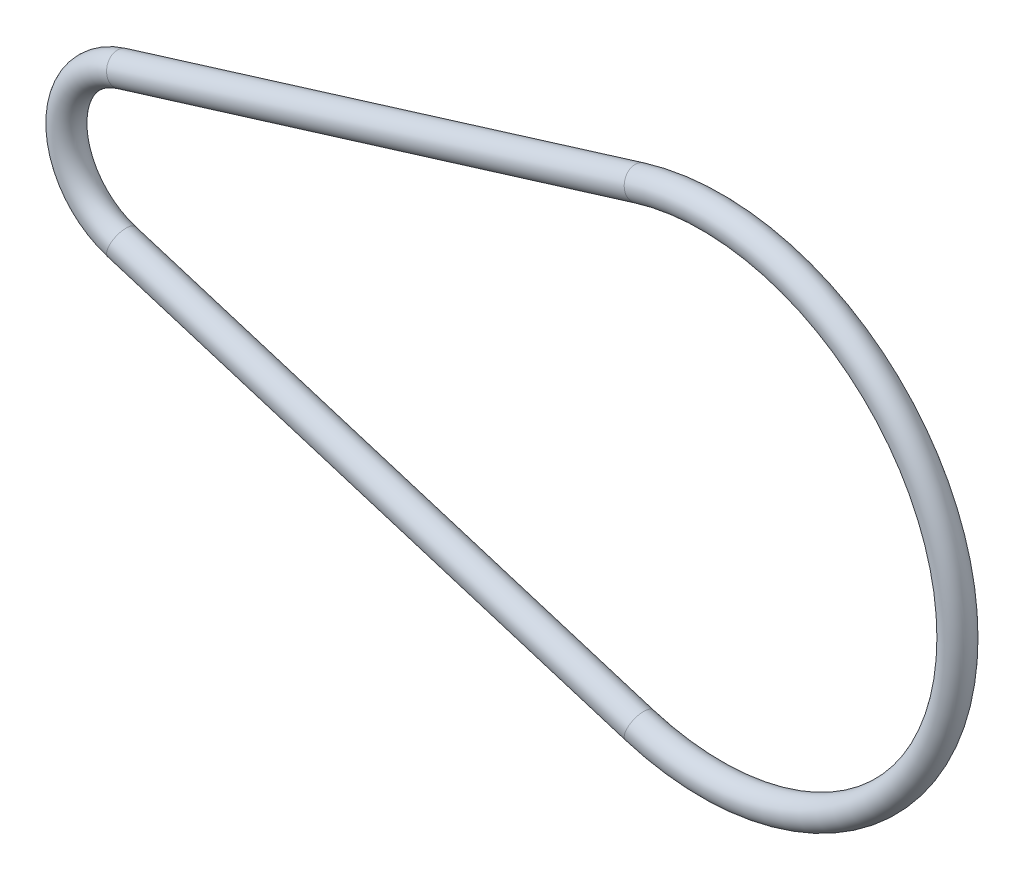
ISO-10303-21;
HEADER;
FILE_DESCRIPTION(('STEP AP214'),'2;1');
FILE_NAME('part.step','',(''),(''),'','','');
FILE_SCHEMA(('AUTOMOTIVE_DESIGN { 1 0 10303 214 1 1 1 1 }'));
ENDSEC;
DATA;
#1=APPLICATION_CONTEXT('core data for automotive mechanical design processes');
#2=APPLICATION_PROTOCOL_DEFINITION('international standard','automotive_design',2000,#1);
#3=PRODUCT_CONTEXT('',#1,'mechanical');
#4=PRODUCT('Part','Part','',(#3));
#5=PRODUCT_RELATED_PRODUCT_CATEGORY('part','',(#4));
#6=PRODUCT_DEFINITION_FORMATION('','',#4);
#7=PRODUCT_DEFINITION_CONTEXT('part definition',#1,'design');
#8=PRODUCT_DEFINITION('design','',#6,#7);
#9=PRODUCT_DEFINITION_SHAPE('','',#8);
#10=(LENGTH_UNIT() NAMED_UNIT(*) SI_UNIT(.MILLI.,.METRE.));
#11=(NAMED_UNIT(*) PLANE_ANGLE_UNIT() SI_UNIT($,.RADIAN.));
#12=(NAMED_UNIT(*) SI_UNIT($,.STERADIAN.) SOLID_ANGLE_UNIT());
#13=UNCERTAINTY_MEASURE_WITH_UNIT(LENGTH_MEASURE(1.E-05),#10,'distance_accuracy_value','');
#14=(GEOMETRIC_REPRESENTATION_CONTEXT(3) GLOBAL_UNCERTAINTY_ASSIGNED_CONTEXT((#13)) GLOBAL_UNIT_ASSIGNED_CONTEXT((#10,
#11,#12)) REPRESENTATION_CONTEXT('',''));
#15=CARTESIAN_POINT('',(0.,0.,0.));
#16=DIRECTION('',(0.,0.,1.));
#17=DIRECTION('',(1.,0.,0.));
#18=AXIS2_PLACEMENT_3D('',#15,#16,#17);
#19=CARTESIAN_POINT('',(-1.59230769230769,-5.15989885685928,0.));
#20=DIRECTION('',(0.955536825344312,-0.294871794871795,0.));
#21=DIRECTION('',(0.294871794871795,0.955536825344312,0.));
#22=AXIS2_PLACEMENT_3D('',#19,#20,#21);
#23=CYLINDRICAL_SURFACE('',#22,0.999999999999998);
#24=CARTESIAN_POINT('',(-1.59230769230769,-5.15989885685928,0.));
#25=DIRECTION('',(0.955536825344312,-0.294871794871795,0.));
#26=DIRECTION('',(0.,0.,1.));
#27=AXIS2_PLACEMENT_3D('',#24,#25,#26);
#28=CIRCLE('',#27,0.999999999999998);
#29=CARTESIAN_POINT('',(-1.88717948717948,-6.11543568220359,0.));
#30=VERTEX_POINT('',#29);
#31=EDGE_CURVE('E35',#30,#30,#28,.T.);
#32=ORIENTED_EDGE('',*,*,#31,.T.);
#33=EDGE_LOOP('',(#32));
#34=FACE_BOUND('',#33,.T.);
#35=CARTESIAN_POINT('',(34.0166666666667,-16.1485723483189,0.));
#36=DIRECTION('',(0.955536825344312,-0.294871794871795,0.));
#37=DIRECTION('',(0.,0.,1.));
#38=AXIS2_PLACEMENT_3D('',#35,#36,#37);
#39=CIRCLE('',#38,0.999999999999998);
#40=CARTESIAN_POINT('',(33.7217948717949,-17.1041091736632,0.));
#41=VERTEX_POINT('',#40);
#42=EDGE_CURVE('E10',#41,#41,#39,.T.);
#43=ORIENTED_EDGE('',*,*,#42,.F.);
#44=EDGE_LOOP('',(#43));
#45=FACE_BOUND('',#44,.T.);
#46=ADVANCED_FACE('F29',(#34,#45),#23,.T.);
#47=CARTESIAN_POINT('',(0.,0.,0.));
#48=DIRECTION('',(0.,0.,1.));
#49=DIRECTION('',(1.,0.,0.));
#50=AXIS2_PLACEMENT_3D('',#47,#48,#49);
#51=TOROIDAL_SURFACE('',#50,5.39999999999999,0.999999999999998);
#52=CARTESIAN_POINT('',(-1.59230769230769,5.15989885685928,0.));
#53=DIRECTION('',(-0.955536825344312,-0.294871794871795,0.));
#54=DIRECTION('',(0.,0.,1.));
#55=AXIS2_PLACEMENT_3D('',#52,#53,#54);
#56=CIRCLE('',#55,0.999999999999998);
#57=CARTESIAN_POINT('',(-1.88717948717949,6.11543568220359,0.));
#58=VERTEX_POINT('',#57);
#59=EDGE_CURVE('E39',#58,#58,#56,.T.);
#60=CARTESIAN_POINT('',(0.,0.,0.));
#61=DIRECTION('',(0.,0.,1.));
#62=DIRECTION('',(1.,0.,0.));
#63=AXIS2_PLACEMENT_3D('',#60,#61,#62);
#64=CIRCLE('',#63,6.39999999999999);
#65=EDGE_CURVE('',#58,#30,#64,.T.);
#66=ORIENTED_EDGE('',*,*,#59,.T.);
#67=ORIENTED_EDGE('',*,*,#31,.F.);
#68=ORIENTED_EDGE('',*,*,#65,.T.);
#69=ORIENTED_EDGE('',*,*,#65,.F.);
#70=EDGE_LOOP('',(#66,#68,#67,#69));
#71=FACE_BOUND('',#70,.T.);
#72=ADVANCED_FACE('F58',(#71),#51,.T.);
#73=CARTESIAN_POINT('',(34.0166666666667,16.1485723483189,0.));
#74=DIRECTION('',(-0.955536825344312,-0.294871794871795,0.));
#75=DIRECTION('',(0.294871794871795,-0.955536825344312,0.));
#76=AXIS2_PLACEMENT_3D('',#73,#74,#75);
#77=CYLINDRICAL_SURFACE('',#76,0.999999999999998);
#78=CARTESIAN_POINT('',(34.0166666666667,16.1485723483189,0.));
#79=DIRECTION('',(-0.955536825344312,-0.294871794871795,0.));
#80=DIRECTION('',(0.,0.,1.));
#81=AXIS2_PLACEMENT_3D('',#78,#79,#80);
#82=CIRCLE('',#81,0.999999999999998);
#83=CARTESIAN_POINT('',(33.7217948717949,17.1041091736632,0.));
#84=VERTEX_POINT('',#83);
#85=EDGE_CURVE('E43',#84,#84,#82,.T.);
#86=ORIENTED_EDGE('',*,*,#85,.T.);
#87=EDGE_LOOP('',(#86));
#88=FACE_BOUND('',#87,.T.);
#89=ORIENTED_EDGE('',*,*,#59,.F.);
#90=EDGE_LOOP('',(#89));
#91=FACE_BOUND('',#90,.T.);
#92=ADVANCED_FACE('F49',(#88,#91),#77,.T.);
#93=CARTESIAN_POINT('',(39.,0.,0.));
#94=DIRECTION('',(0.,0.,-1.));
#95=DIRECTION('',(-1.,0.,0.));
#96=AXIS2_PLACEMENT_3D('',#93,#94,#95);
#97=TOROIDAL_SURFACE('',#96,16.9,0.999999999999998);
#98=CARTESIAN_POINT('',(39.,0.,0.));
#99=DIRECTION('',(0.,0.,-1.));
#100=DIRECTION('',(-1.,0.,0.));
#101=AXIS2_PLACEMENT_3D('',#98,#99,#100);
#102=CIRCLE('',#101,17.9);
#103=EDGE_CURVE('',#84,#41,#102,.T.);
#104=ORIENTED_EDGE('',*,*,#85,.F.);
#105=ORIENTED_EDGE('',*,*,#42,.T.);
#106=ORIENTED_EDGE('',*,*,#103,.T.);
#107=ORIENTED_EDGE('',*,*,#103,.F.);
#108=EDGE_LOOP('',(#104,#106,#105,#107));
#109=FACE_BOUND('',#108,.T.);
#110=ADVANCED_FACE('F52',(#109),#97,.T.);
#111=CLOSED_SHELL('',(#46,#72,#92,#110));
#112=MANIFOLD_SOLID_BREP('B2',#111);
#113=ADVANCED_BREP_SHAPE_REPRESENTATION('',(#18,#112),#14);
#114=SHAPE_DEFINITION_REPRESENTATION(#9,#113);
ENDSEC;
END-ISO-10303-21;
